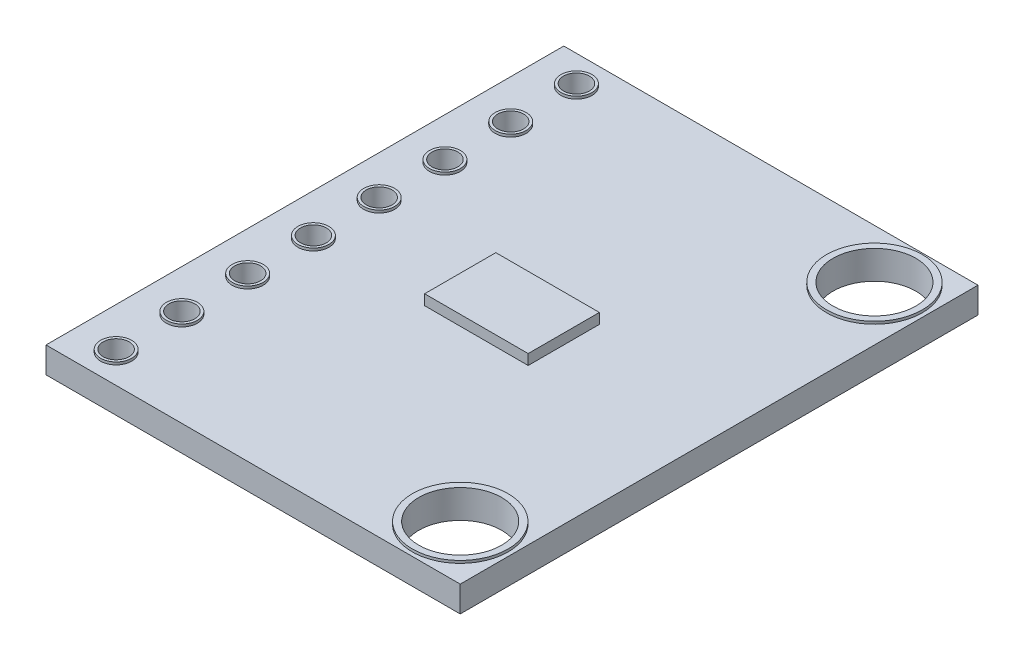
from build123d import *

# Parameters (mm, degrees)
SKETCH1_W                   = 16
SKETCH1_H                   = 20
BOSS_EXTRUDE1_DEPTH         = 1
SKETCH4_W                   = 4
SKETCH4_H                   = 2.75
BOSS_EXTRUDE3_DEPTH         = 0.4
IZIM1_R                     = 0.6
IZIM1_R_2                   = 0.5
Y_KSEKLIK_EKSTR_ZYON1_DEPTH = 0.1
KES_EKSTR_ZYON2_START       = -20.1
IZIM3_R                     = 0.5
KES_EKSTR_ZYON2_DEPTH       = 20.1
IZIM4_R                     = 1.85
IZIM4_R_2                   = 1.6
Y_KSEKLIK_EKSTR_ZYON2_DEPTH = 0.1
KES_EKSTR_ZYON3_START       = -10.1
IZIM5_R                     = 1.6
KES_EKSTR_ZYON3_DEPTH       = 10.1


with BuildPart() as part:
    # Sketch1 → Boss-Extrude1 (new body)
    with BuildSketch(Plane(origin=(0, 0, 0), x_dir=(1, 0, 0), z_dir=(0, 1, 0))):
        Rectangle(SKETCH1_W, SKETCH1_H)
    extrude(amount=BOSS_EXTRUDE1_DEPTH)

    # izim1 → Y_kseklik-Ekstr_zyon1 (add)
    # profile 1 of 8: a face of its own
    with BuildSketch(Plane(origin=(0, 1, 0), x_dir=(1, 0, 0), z_dir=(0, 1, 0))):
        with Locations(Location((-6.400785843, -8.89, 0), (0, 0, 90))):
            Circle(IZIM1_R)
        with Locations(Location((-6.400785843, -8.89, 0), (0, 0, 270))):
            Circle(IZIM1_R_2, mode=Mode.SUBTRACT)
    # profile 2 of 8: a face of its own
    with BuildSketch(Plane(origin=(0, 1, 0), x_dir=(1, 0, 0), z_dir=(0, 1, 0))):
        with Locations(Location((-6.400785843, -6.35, 0), (0, 0, 90))):
            Circle(IZIM1_R)
        with Locations(Location((-6.400785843, -6.35, 0), (0, 0, 270))):
            Circle(IZIM1_R_2, mode=Mode.SUBTRACT)
    # profile 3 of 8: a face of its own
    with BuildSketch(Plane(origin=(0, 1, 0), x_dir=(1, 0, 0), z_dir=(0, 1, 0))):
        with Locations(Location((-6.400785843, -3.81, 0), (0, 0, 90))):
            Circle(IZIM1_R)
        with Locations(Location((-6.400785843, -3.81, 0), (0, 0, 270))):
            Circle(IZIM1_R_2, mode=Mode.SUBTRACT)
    # profile 4 of 8: a face of its own
    with BuildSketch(Plane(origin=(0, 1, 0), x_dir=(1, 0, 0), z_dir=(0, 1, 0))):
        with Locations(Location((-6.400785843, -1.27, 0), (0, 0, 90))):
            Circle(IZIM1_R)
        with Locations(Location((-6.400785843, -1.27, 0), (0, 0, 270))):
            Circle(IZIM1_R_2, mode=Mode.SUBTRACT)
    # profile 5 of 8: a face of its own
    with BuildSketch(Plane(origin=(0, 1, 0), x_dir=(1, 0, 0), z_dir=(0, 1, 0))):
        with Locations(Location((-6.400785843, 1.27, 0), (0, 0, 90))):
            Circle(IZIM1_R)
        with Locations(Location((-6.400785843, 1.27, 0), (0, 0, 270))):
            Circle(IZIM1_R_2, mode=Mode.SUBTRACT)
    # profile 6 of 8: a face of its own
    with BuildSketch(Plane(origin=(0, 1, 0), x_dir=(1, 0, 0), z_dir=(0, 1, 0))):
        with Locations(Location((-6.400785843, 3.81, 0), (0, 0, 90))):
            Circle(IZIM1_R)
        with Locations(Location((-6.400785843, 3.81, 0), (0, 0, 270))):
            Circle(IZIM1_R_2, mode=Mode.SUBTRACT)
    # profile 7 of 8: a face of its own
    with BuildSketch(Plane(origin=(0, 1, 0), x_dir=(1, 0, 0), z_dir=(0, 1, 0))):
        with Locations(Location((-6.400785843, 6.35, 0), (0, 0, 90))):
            Circle(IZIM1_R)
        with Locations(Location((-6.400785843, 6.35, 0), (0, 0, 270))):
            Circle(IZIM1_R_2, mode=Mode.SUBTRACT)
    # profile 8 of 8: a face of its own
    with BuildSketch(Plane(origin=(0, 1, 0), x_dir=(1, 0, 0), z_dir=(0, 1, 0))):
        with Locations(Location((-6.400785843, 8.89, 0), (0, 0, 90))):
            Circle(IZIM1_R)
        with Locations(Location((-6.400785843, 8.89, 0), (0, 0, 270))):
            Circle(IZIM1_R_2, mode=Mode.SUBTRACT)
    extrude(amount=Y_KSEKLIK_EKSTR_ZYON1_DEPTH)

    # izim3 → Kes-Ekstr_zyon2 (cut)
    with BuildSketch(Plane(origin=(0, 1, 0), x_dir=(1, 0, 0), z_dir=(0, 1, 0)).offset(KES_EKSTR_ZYON2_START)):
        with Locations(Location((-6.400785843, -8.89, 0), (0, 0, 90))):
            Circle(IZIM3_R)
        with Locations(Location((-6.400785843, -6.35, 0), (0, 0, 90))):
            Circle(IZIM3_R)
        with Locations(Location((-6.400785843, -3.81, 0), (0, 0, 90))):
            Circle(IZIM3_R)
        with Locations(Location((-6.400785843, -1.27, 0), (0, 0, 90))):
            Circle(IZIM3_R)
        with Locations(Location((-6.400785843, 1.27, 0), (0, 0, 90))):
            Circle(IZIM3_R)
        with Locations(Location((-6.400785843, 3.81, 0), (0, 0, 90))):
            Circle(IZIM3_R)
        with Locations(Location((-6.400785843, 6.35, 0), (0, 0, 90))):
            Circle(IZIM3_R)
        with Locations(Location((-6.400785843, 8.89, 0), (0, 0, 90))):
            Circle(IZIM3_R)
    extrude(amount=KES_EKSTR_ZYON2_DEPTH, mode=Mode.SUBTRACT)

    # izim4 → Y_kseklik-Ekstr_zyon2 (add)
    # profile 1 of 2: a face of its own
    with BuildSketch(Plane(origin=(0, 1, 0), x_dir=(1, 0, 0), z_dir=(0, 1, 0))):
        with Locations(Location((6, -8, 0), (0, 0, 90))):
            Circle(IZIM4_R)
        with Locations(Location((6, -8, 0), (0, 0, 270))):
            Circle(IZIM4_R_2, mode=Mode.SUBTRACT)
    # profile 2 of 2: a face of its own
    with BuildSketch(Plane(origin=(0, 1, 0), x_dir=(1, 0, 0), z_dir=(0, 1, 0))):
        with Locations(Location((6, 8, 0), (0, 0, 90))):
            Circle(IZIM4_R)
        with Locations(Location((6, 8, 0), (0, 0, 270))):
            Circle(IZIM4_R_2, mode=Mode.SUBTRACT)
    extrude(amount=Y_KSEKLIK_EKSTR_ZYON2_DEPTH)

    # izim5 → Kes-Ekstr_zyon3 (cut)
    with BuildSketch(Plane(origin=(0, 1, 0), x_dir=(1, 0, 0), z_dir=(0, 1, 0)).offset(KES_EKSTR_ZYON3_START)):
        with Locations(Location((6, 8, 0), (0, 0, 90))):
            Circle(IZIM5_R)
        with Locations(Location((6, -8, 0), (0, 0, 90))):
            Circle(IZIM5_R)
    extrude(amount=KES_EKSTR_ZYON3_DEPTH, mode=Mode.SUBTRACT)


with BuildPart() as body_2:
    # Sketch4 → Boss-Extrude3 (new body)
    with BuildSketch(Plane(origin=(0, 1, 0), x_dir=(1, 0, 0), z_dir=(0, 1, 0))):
        Rectangle(SKETCH4_W, SKETCH4_H)
    extrude(amount=BOSS_EXTRUDE3_DEPTH)


solid = Compound([part.part, body_2.part])
